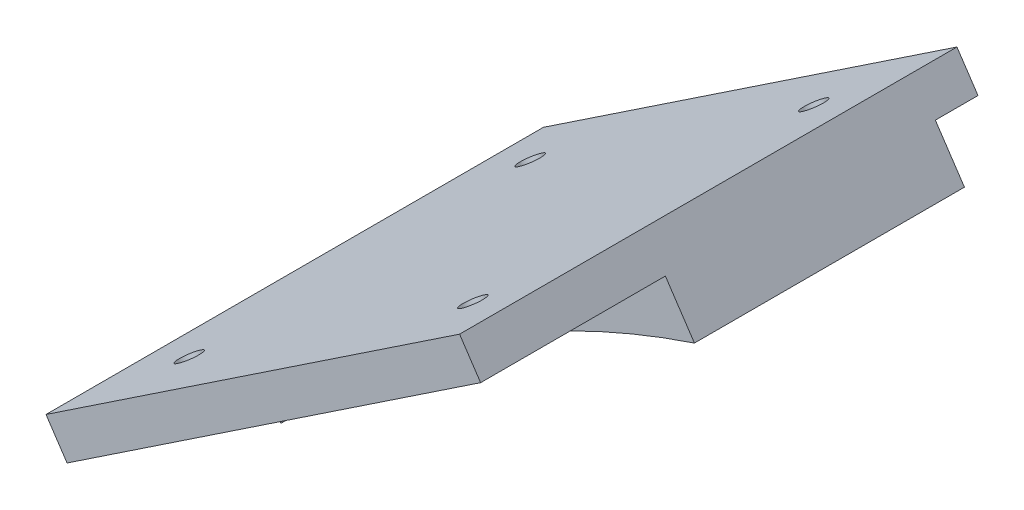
ISO-10303-21;
HEADER;
FILE_DESCRIPTION(('STEP AP214'),'2;1');
FILE_NAME('part.step','',(''),(''),'','','');
FILE_SCHEMA(('AUTOMOTIVE_DESIGN { 1 0 10303 214 1 1 1 1 }'));
ENDSEC;
DATA;
#1=APPLICATION_CONTEXT('core data for automotive mechanical design processes');
#2=APPLICATION_PROTOCOL_DEFINITION('international standard','automotive_design',2000,#1);
#3=PRODUCT_CONTEXT('',#1,'mechanical');
#4=PRODUCT('Part','Part','',(#3));
#5=PRODUCT_RELATED_PRODUCT_CATEGORY('part','',(#4));
#6=PRODUCT_DEFINITION_FORMATION('','',#4);
#7=PRODUCT_DEFINITION_CONTEXT('part definition',#1,'design');
#8=PRODUCT_DEFINITION('design','',#6,#7);
#9=PRODUCT_DEFINITION_SHAPE('','',#8);
#10=(LENGTH_UNIT() NAMED_UNIT(*) SI_UNIT(.MILLI.,.METRE.));
#11=(NAMED_UNIT(*) PLANE_ANGLE_UNIT() SI_UNIT($,.RADIAN.));
#12=(NAMED_UNIT(*) SI_UNIT($,.STERADIAN.) SOLID_ANGLE_UNIT());
#13=UNCERTAINTY_MEASURE_WITH_UNIT(LENGTH_MEASURE(1.E-05),#10,'distance_accuracy_value','');
#14=(GEOMETRIC_REPRESENTATION_CONTEXT(3) GLOBAL_UNCERTAINTY_ASSIGNED_CONTEXT((#13)) GLOBAL_UNIT_ASSIGNED_CONTEXT((#10,
#11,#12)) REPRESENTATION_CONTEXT('',''));
#15=CARTESIAN_POINT('',(0.,0.,0.));
#16=DIRECTION('',(0.,0.,1.));
#17=DIRECTION('',(1.,0.,0.));
#18=AXIS2_PLACEMENT_3D('',#15,#16,#17);
#19=CARTESIAN_POINT('',(0.,-3.80918109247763E-06,-218.25));
#20=DIRECTION('',(0.,1.74532925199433E-08,1.));
#21=DIRECTION('',(-0.831469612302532,-0.555570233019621,9.69652979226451E-09));
#22=AXIS2_PLACEMENT_3D('',#19,#20,#21);
#23=PLANE('',#22);
#24=DIRECTION('',(-0.831469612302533,-0.555570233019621,9.69652979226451E-09));
#25=VECTOR('',#24,1.);
#26=CARTESIAN_POINT('',(-73.5731645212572,204.607521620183,-218.250003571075));
#27=LINE('',#26,#25);
#28=CARTESIAN_POINT('',(-73.5731645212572,204.607521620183,-218.250003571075));
#29=VERTEX_POINT('',#28);
#30=CARTESIAN_POINT('',(-160.877473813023,146.272647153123,-218.250002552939));
#31=VERTEX_POINT('',#30);
#32=EDGE_CURVE('E95',#29,#31,#27,.T.);
#33=ORIENTED_EDGE('',*,*,#32,.F.);
#34=DIRECTION('',(-0.555570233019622,0.831469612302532,-1.45118823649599E-08));
#35=VECTOR('',#34,1.);
#36=CARTESIAN_POINT('',(-69.1286026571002,197.955764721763,-218.25000345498));
#37=LINE('',#36,#35);
#38=CARTESIAN_POINT('',(-69.1286026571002,197.955764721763,-218.25000345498));
#39=VERTEX_POINT('',#38);
#40=EDGE_CURVE('E67',#39,#29,#37,.T.);
#41=ORIENTED_EDGE('',*,*,#40,.F.);
#42=DIRECTION('',(0.831469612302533,0.555570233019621,-9.69652979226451E-09));
#43=VECTOR('',#42,1.);
#44=CARTESIAN_POINT('',(-156.432911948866,139.620890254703,-218.250002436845));
#45=LINE('',#44,#43);
#46=CARTESIAN_POINT('',(-156.432911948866,139.620890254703,-218.250002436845));
#47=VERTEX_POINT('',#46);
#48=EDGE_CURVE('E90',#47,#39,#45,.T.);
#49=ORIENTED_EDGE('',*,*,#48,.F.);
#50=DIRECTION('',(0.555570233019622,-0.831469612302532,1.45118823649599E-08));
#51=VECTOR('',#50,1.);
#52=CARTESIAN_POINT('',(-160.877473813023,146.272647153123,-218.250002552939));
#53=LINE('',#52,#51);
#54=EDGE_CURVE('E11',#31,#47,#53,.T.);
#55=ORIENTED_EDGE('',*,*,#54,.F.);
#56=EDGE_LOOP('',(#33,#41,#49,#55));
#57=FACE_BOUND('',#56,.T.);
#58=ADVANCED_FACE('F40',(#57),#23,.F.);
#59=CARTESIAN_POINT('',(-160.877473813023,146.272647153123,-218.250002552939));
#60=DIRECTION('',(-0.831469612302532,-0.555570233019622,9.69652979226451E-09));
#61=DIRECTION('',(0.555570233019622,-0.831469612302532,1.45118823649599E-08));
#62=AXIS2_PLACEMENT_3D('',#59,#60,#61);
#63=PLANE('',#62);
#64=DIRECTION('',(0.,-1.74532925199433E-08,-1.));
#65=VECTOR('',#64,1.);
#66=CARTESIAN_POINT('',(-156.432911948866,139.620892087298,-113.250002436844));
#67=LINE('',#66,#65);
#68=CARTESIAN_POINT('',(-156.432911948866,139.620892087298,-113.250002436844));
#69=VERTEX_POINT('',#68);
#70=CARTESIAN_POINT('',(-156.432911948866,139.62089140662,-152.250002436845));
#71=VERTEX_POINT('',#70);
#72=EDGE_CURVE('E169',#69,#71,#67,.T.);
#73=ORIENTED_EDGE('',*,*,#72,.F.);
#74=DIRECTION('',(0.555570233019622,-0.831469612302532,1.45118823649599E-08));
#75=VECTOR('',#74,1.);
#76=CARTESIAN_POINT('',(-160.877473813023,146.272648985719,-113.250002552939));
#77=LINE('',#76,#75);
#78=CARTESIAN_POINT('',(-160.877473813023,146.272648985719,-113.250002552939));
#79=VERTEX_POINT('',#78);
#80=EDGE_CURVE('E190',#79,#69,#77,.T.);
#81=ORIENTED_EDGE('',*,*,#80,.F.);
#82=DIRECTION('',(0.,1.74532925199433E-08,1.));
#83=VECTOR('',#82,1.);
#84=CARTESIAN_POINT('',(-160.877473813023,146.272647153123,-218.250002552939));
#85=LINE('',#84,#83);
#86=EDGE_CURVE('E161',#31,#79,#85,.T.);
#87=ORIENTED_EDGE('',*,*,#86,.F.);
#88=ORIENTED_EDGE('',*,*,#54,.T.);
#89=DIRECTION('',(0.,1.74532925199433E-08,1.));
#90=VECTOR('',#89,1.);
#91=CARTESIAN_POINT('',(-156.432911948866,139.620890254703,-218.250002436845));
#92=LINE('',#91,#90);
#93=CARTESIAN_POINT('',(-156.432911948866,139.620890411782,-209.250002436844));
#94=VERTEX_POINT('',#93);
#95=EDGE_CURVE('E56',#47,#94,#92,.T.);
#96=ORIENTED_EDGE('',*,*,#95,.T.);
#97=DIRECTION('',(-0.555570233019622,0.831469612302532,-1.45118823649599E-08));
#98=VECTOR('',#97,1.);
#99=CARTESIAN_POINT('',(-150.293784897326,130.433037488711,-209.250002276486));
#100=LINE('',#99,#98);
#101=CARTESIAN_POINT('',(-150.293784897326,130.433037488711,-209.250002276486));
#102=VERTEX_POINT('',#101);
#103=EDGE_CURVE('E136',#102,#94,#100,.T.);
#104=ORIENTED_EDGE('',*,*,#103,.F.);
#105=DIRECTION('',(0.,1.74532925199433E-08,1.));
#106=VECTOR('',#105,1.);
#107=CARTESIAN_POINT('',(-150.293784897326,130.433037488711,-209.250002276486));
#108=LINE('',#107,#106);
#109=CARTESIAN_POINT('',(-150.293784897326,130.433038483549,-152.250002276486));
#110=VERTEX_POINT('',#109);
#111=EDGE_CURVE('E149',#102,#110,#108,.T.);
#112=ORIENTED_EDGE('',*,*,#111,.T.);
#113=DIRECTION('',(-0.555570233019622,0.831469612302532,-1.45118823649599E-08));
#114=VECTOR('',#113,1.);
#115=CARTESIAN_POINT('',(-150.293784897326,130.433038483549,-152.250002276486));
#116=LINE('',#115,#114);
#117=EDGE_CURVE('E170',#110,#71,#116,.T.);
#118=ORIENTED_EDGE('',*,*,#117,.T.);
#119=EDGE_LOOP('',(#73,#81,#87,#88,#96,#104,#112,#118));
#120=FACE_BOUND('',#119,.T.);
#121=ADVANCED_FACE('F227',(#120),#63,.T.);
#122=CARTESIAN_POINT('',(-46.5089159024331,183.002513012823,-152.250003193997));
#123=DIRECTION('',(0.,-1.74532925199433E-08,-1.));
#124=DIRECTION('',(-0.555570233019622,0.831469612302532,-1.45118823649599E-08));
#125=AXIS2_PLACEMENT_3D('',#122,#123,#124);
#126=PLANE('',#125);
#127=CARTESIAN_POINT('',(0.,-2.65726378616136E-06,-152.25));
#128=DIRECTION('',(0.,1.74532925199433E-08,1.));
#129=DIRECTION('',(-0.316530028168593,0.948582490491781,-1.65558876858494E-08));
#130=AXIS2_PLACEMENT_3D('',#127,#128,#129);
#131=CIRCLE('',#130,199.);
#132=CARTESIAN_POINT('',(-62.9894756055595,188.767912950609,-152.250003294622));
#133=VERTEX_POINT('',#132);
#134=EDGE_CURVE('E137',#133,#110,#131,.T.);
#135=ORIENTED_EDGE('',*,*,#134,.F.);
#136=DIRECTION('',(-0.555570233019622,0.831469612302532,-1.45118823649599E-08));
#137=VECTOR('',#136,1.);
#138=CARTESIAN_POINT('',(-62.9894756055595,188.767912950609,-152.250003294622));
#139=LINE('',#138,#137);
#140=CARTESIAN_POINT('',(-69.1286026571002,197.95576587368,-152.25000345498));
#141=VERTEX_POINT('',#140);
#142=EDGE_CURVE('E131',#133,#141,#139,.T.);
#143=ORIENTED_EDGE('',*,*,#142,.T.);
#144=DIRECTION('',(-0.831469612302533,-0.555570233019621,9.69652979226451E-09));
#145=VECTOR('',#144,1.);
#146=CARTESIAN_POINT('',(-69.1286026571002,197.95576587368,-152.25000345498));
#147=LINE('',#146,#145);
#148=EDGE_CURVE('E165',#141,#71,#147,.T.);
#149=ORIENTED_EDGE('',*,*,#148,.T.);
#150=ORIENTED_EDGE('',*,*,#117,.F.);
#151=EDGE_LOOP('',(#135,#143,#149,#150));
#152=FACE_BOUND('',#151,.T.);
#153=ADVANCED_FACE('F232',(#152),#126,.F.);
#154=CARTESIAN_POINT('',(-60.3981717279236,203.789253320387,-152.250003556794));
#155=DIRECTION('',(-0.555570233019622,0.831469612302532,-1.45118823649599E-08));
#156=DIRECTION('',(0.,-1.74532925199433E-08,-1.));
#157=AXIS2_PLACEMENT_3D('',#154,#155,#156);
#158=PLANE('',#157);
#159=CARTESIAN_POINT('',(-82.8478512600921,188.788857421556,-129.750003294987));
#160=DIRECTION('',(-0.555570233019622,0.831469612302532,-1.45118823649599E-08));
#161=DIRECTION('',(-0.831469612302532,-0.555570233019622,0.));
#162=AXIS2_PLACEMENT_3D('',#159,#160,#161);
#163=CIRCLE('',#162,2.5);
#164=CARTESIAN_POINT('',(-84.9265252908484,187.399931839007,-129.750003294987));
#165=VERTEX_POINT('',#164);
#166=EDGE_CURVE('E414',#165,#165,#163,.T.);
#167=ORIENTED_EDGE('',*,*,#166,.T.);
#168=EDGE_LOOP('',(#167));
#169=FACE_BOUND('',#168,.T.);
#170=CARTESIAN_POINT('',(-142.713663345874,148.787800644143,-129.750002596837));
#171=DIRECTION('',(-0.555570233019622,0.831469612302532,-1.45118823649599E-08));
#172=DIRECTION('',(-0.831469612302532,-0.555570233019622,0.));
#173=AXIS2_PLACEMENT_3D('',#170,#171,#172);
#174=CIRCLE('',#173,2.5);
#175=CARTESIAN_POINT('',(-144.792337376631,147.398875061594,-129.750002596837));
#176=VERTEX_POINT('',#175);
#177=EDGE_CURVE('E164',#176,#176,#174,.T.);
#178=ORIENTED_EDGE('',*,*,#177,.T.);
#179=EDGE_LOOP('',(#178));
#180=FACE_BOUND('',#179,.T.);
#181=ORIENTED_EDGE('',*,*,#72,.T.);
#182=ORIENTED_EDGE('',*,*,#148,.F.);
#183=DIRECTION('',(0.,-1.74532925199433E-08,-1.));
#184=VECTOR('',#183,1.);
#185=CARTESIAN_POINT('',(-69.1286026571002,197.955766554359,-113.25000345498));
#186=LINE('',#185,#184);
#187=CARTESIAN_POINT('',(-69.1286026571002,197.955766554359,-113.25000345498));
#188=VERTEX_POINT('',#187);
#189=EDGE_CURVE('E177',#188,#141,#186,.T.);
#190=ORIENTED_EDGE('',*,*,#189,.F.);
#191=DIRECTION('',(0.831469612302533,0.555570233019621,-9.69652979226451E-09));
#192=VECTOR('',#191,1.);
#193=CARTESIAN_POINT('',(-156.432911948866,139.620892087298,-113.250002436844));
#194=LINE('',#193,#192);
#195=EDGE_CURVE('E186',#69,#188,#194,.T.);
#196=ORIENTED_EDGE('',*,*,#195,.F.);
#197=EDGE_LOOP('',(#181,#182,#190,#196));
#198=FACE_BOUND('',#197,.T.);
#199=ADVANCED_FACE('F228',(#169,#180,#198),#158,.F.);
#200=CARTESIAN_POINT('',(0.,-1.97658537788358E-06,-113.25));
#201=DIRECTION('',(0.,1.74532925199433E-08,1.));
#202=DIRECTION('',(-0.831469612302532,-0.555570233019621,9.69652979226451E-09));
#203=AXIS2_PLACEMENT_3D('',#200,#201,#202);
#204=PLANE('',#203);
#205=DIRECTION('',(-0.555570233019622,0.831469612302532,-1.45118823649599E-08));
#206=VECTOR('',#205,1.);
#207=CARTESIAN_POINT('',(-69.1286026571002,197.955766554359,-113.25000345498));
#208=LINE('',#207,#206);
#209=CARTESIAN_POINT('',(-73.5731645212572,204.607523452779,-113.250003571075));
#210=VERTEX_POINT('',#209);
#211=EDGE_CURVE('E180',#188,#210,#208,.T.);
#212=ORIENTED_EDGE('',*,*,#211,.T.);
#213=DIRECTION('',(-0.831469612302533,-0.555570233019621,9.69652979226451E-09));
#214=VECTOR('',#213,1.);
#215=CARTESIAN_POINT('',(-73.5731645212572,204.607523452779,-113.250003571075));
#216=LINE('',#215,#214);
#217=EDGE_CURVE('E198',#210,#79,#216,.T.);
#218=ORIENTED_EDGE('',*,*,#217,.T.);
#219=ORIENTED_EDGE('',*,*,#80,.T.);
#220=ORIENTED_EDGE('',*,*,#195,.T.);
#221=EDGE_LOOP('',(#212,#218,#219,#220));
#222=FACE_BOUND('',#221,.T.);
#223=ADVANCED_FACE('F231',(#222),#204,.T.);
#224=CARTESIAN_POINT('',(-73.5731645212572,204.607521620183,-218.250003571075));
#225=DIRECTION('',(-0.555570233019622,0.831469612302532,-1.45118823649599E-08));
#226=DIRECTION('',(0.,-1.74532925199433E-08,-1.));
#227=AXIS2_PLACEMENT_3D('',#224,#225,#226);
#228=PLANE('',#227);
#229=CARTESIAN_POINT('',(-147.158225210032,155.439556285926,-201.750002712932));
#230=DIRECTION('',(-0.555570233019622,0.831469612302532,-1.45118823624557E-08));
#231=DIRECTION('',(-0.831469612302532,-0.555570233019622,0.));
#232=AXIS2_PLACEMENT_3D('',#229,#230,#231);
#233=CIRCLE('',#232,2.5);
#234=CARTESIAN_POINT('',(-149.236899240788,154.050630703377,-201.750002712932));
#235=VERTEX_POINT('',#234);
#236=EDGE_CURVE('E392',#235,#235,#233,.T.);
#237=ORIENTED_EDGE('',*,*,#236,.F.);
#238=EDGE_LOOP('',(#237));
#239=FACE_BOUND('',#238,.T.);
#240=CARTESIAN_POINT('',(-87.2924131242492,195.440613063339,-201.750003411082));
#241=DIRECTION('',(-0.555570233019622,0.831469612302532,-1.45118823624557E-08));
#242=DIRECTION('',(-0.831469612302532,-0.555570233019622,0.));
#243=AXIS2_PLACEMENT_3D('',#240,#241,#242);
#244=CIRCLE('',#243,2.5);
#245=CARTESIAN_POINT('',(-89.3710871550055,194.05168748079,-201.750003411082));
#246=VERTEX_POINT('',#245);
#247=EDGE_CURVE('E402',#246,#246,#244,.T.);
#248=ORIENTED_EDGE('',*,*,#247,.F.);
#249=EDGE_LOOP('',(#248));
#250=FACE_BOUND('',#249,.T.);
#251=CARTESIAN_POINT('',(-87.2924131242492,195.440614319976,-129.750003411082));
#252=DIRECTION('',(-0.555570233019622,0.831469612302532,-1.45118823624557E-08));
#253=DIRECTION('',(-0.831469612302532,-0.555570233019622,0.));
#254=AXIS2_PLACEMENT_3D('',#251,#252,#253);
#255=CIRCLE('',#254,2.5);
#256=CARTESIAN_POINT('',(-89.3710871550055,194.051688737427,-129.750003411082));
#257=VERTEX_POINT('',#256);
#258=EDGE_CURVE('E207',#257,#257,#255,.T.);
#259=ORIENTED_EDGE('',*,*,#258,.F.);
#260=EDGE_LOOP('',(#259));
#261=FACE_BOUND('',#260,.T.);
#262=CARTESIAN_POINT('',(-147.158225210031,155.439557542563,-129.750002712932));
#263=DIRECTION('',(-0.555570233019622,0.831469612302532,-1.45118823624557E-08));
#264=DIRECTION('',(-0.831469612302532,-0.555570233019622,0.));
#265=AXIS2_PLACEMENT_3D('',#262,#263,#264);
#266=CIRCLE('',#265,2.5);
#267=CARTESIAN_POINT('',(-149.236899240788,154.050631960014,-129.750002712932));
#268=VERTEX_POINT('',#267);
#269=EDGE_CURVE('E418',#268,#268,#266,.T.);
#270=ORIENTED_EDGE('',*,*,#269,.F.);
#271=EDGE_LOOP('',(#270));
#272=FACE_BOUND('',#271,.T.);
#273=ORIENTED_EDGE('',*,*,#86,.T.);
#274=ORIENTED_EDGE('',*,*,#217,.F.);
#275=DIRECTION('',(0.,1.74532925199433E-08,1.));
#276=VECTOR('',#275,1.);
#277=CARTESIAN_POINT('',(-73.5731645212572,204.607521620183,-218.250003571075));
#278=LINE('',#277,#276);
#279=EDGE_CURVE('E174',#29,#210,#278,.T.);
#280=ORIENTED_EDGE('',*,*,#279,.F.);
#281=ORIENTED_EDGE('',*,*,#32,.T.);
#282=EDGE_LOOP('',(#273,#274,#280,#281));
#283=FACE_BOUND('',#282,.T.);
#284=ADVANCED_FACE('F236',(#239,#250,#261,#272,#283),#228,.T.);
#285=CARTESIAN_POINT('',(-62.9894756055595,188.767911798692,-218.250003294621));
#286=DIRECTION('',(0.831469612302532,0.555570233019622,-9.69652979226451E-09));
#287=DIRECTION('',(0.,1.74532925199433E-08,1.));
#288=AXIS2_PLACEMENT_3D('',#285,#286,#287);
#289=PLANE('',#288);
#290=DIRECTION('',(0.,1.74532925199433E-08,1.));
#291=VECTOR('',#290,1.);
#292=CARTESIAN_POINT('',(-62.9894756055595,188.767911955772,-209.250003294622));
#293=LINE('',#292,#291);
#294=CARTESIAN_POINT('',(-62.9894756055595,188.767911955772,-209.250003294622));
#295=VERTEX_POINT('',#294);
#296=EDGE_CURVE('E124',#295,#133,#293,.T.);
#297=ORIENTED_EDGE('',*,*,#296,.F.);
#298=DIRECTION('',(-0.555570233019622,0.831469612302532,-1.45118823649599E-08));
#299=VECTOR('',#298,1.);
#300=CARTESIAN_POINT('',(-62.9894756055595,188.767911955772,-209.250003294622));
#301=LINE('',#300,#299);
#302=CARTESIAN_POINT('',(-69.1286026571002,197.955764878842,-209.25000345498));
#303=VERTEX_POINT('',#302);
#304=EDGE_CURVE('E127',#295,#303,#301,.T.);
#305=ORIENTED_EDGE('',*,*,#304,.T.);
#306=DIRECTION('',(0.,1.74532925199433E-08,1.));
#307=VECTOR('',#306,1.);
#308=CARTESIAN_POINT('',(-69.1286026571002,197.955764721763,-218.25000345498));
#309=LINE('',#308,#307);
#310=EDGE_CURVE('E428',#39,#303,#309,.T.);
#311=ORIENTED_EDGE('',*,*,#310,.F.);
#312=ORIENTED_EDGE('',*,*,#40,.T.);
#313=ORIENTED_EDGE('',*,*,#279,.T.);
#314=ORIENTED_EDGE('',*,*,#211,.F.);
#315=ORIENTED_EDGE('',*,*,#189,.T.);
#316=ORIENTED_EDGE('',*,*,#142,.F.);
#317=EDGE_LOOP('',(#297,#305,#311,#312,#313,#314,#315,#316));
#318=FACE_BOUND('',#317,.T.);
#319=ADVANCED_FACE('F126',(#318),#289,.T.);
#320=CARTESIAN_POINT('',(-60.3981717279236,203.789251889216,-234.250003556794));
#321=DIRECTION('',(-0.555570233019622,0.831469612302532,-1.45118823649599E-08));
#322=DIRECTION('',(0.,-1.74532925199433E-08,-1.));
#323=AXIS2_PLACEMENT_3D('',#320,#321,#322);
#324=PLANE('',#323);
#325=ORIENTED_EDGE('',*,*,#310,.T.);
#326=DIRECTION('',(-0.831469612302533,-0.555570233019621,9.69652979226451E-09));
#327=VECTOR('',#326,1.);
#328=CARTESIAN_POINT('',(-69.1286026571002,197.955764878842,-209.25000345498));
#329=LINE('',#328,#327);
#330=EDGE_CURVE('E145',#303,#94,#329,.T.);
#331=ORIENTED_EDGE('',*,*,#330,.T.);
#332=ORIENTED_EDGE('',*,*,#95,.F.);
#333=ORIENTED_EDGE('',*,*,#48,.T.);
#334=EDGE_LOOP('',(#325,#331,#332,#333));
#335=FACE_BOUND('',#334,.T.);
#336=ADVANCED_FACE('F247',(#335),#324,.F.);
#337=CARTESIAN_POINT('',(-60.3981717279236,203.789252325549,-209.250003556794));
#338=DIRECTION('',(0.,1.74532925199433E-08,1.));
#339=DIRECTION('',(-0.831469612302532,-0.555570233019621,9.69652979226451E-09));
#340=AXIS2_PLACEMENT_3D('',#337,#338,#339);
#341=PLANE('',#340);
#342=ORIENTED_EDGE('',*,*,#330,.F.);
#343=ORIENTED_EDGE('',*,*,#304,.F.);
#344=CARTESIAN_POINT('',(0.,-3.65210145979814E-06,-209.25));
#345=DIRECTION('',(0.,1.74532925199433E-08,1.));
#346=DIRECTION('',(-0.316530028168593,0.948582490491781,-1.65558876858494E-08));
#347=AXIS2_PLACEMENT_3D('',#344,#345,#346);
#348=CIRCLE('',#347,199.);
#349=EDGE_CURVE('E143',#295,#102,#348,.T.);
#350=ORIENTED_EDGE('',*,*,#349,.T.);
#351=ORIENTED_EDGE('',*,*,#103,.T.);
#352=EDGE_LOOP('',(#342,#343,#350,#351));
#353=FACE_BOUND('',#352,.T.);
#354=ADVANCED_FACE('F141',(#353),#341,.F.);
#355=CARTESIAN_POINT('',(0.,-3.80918109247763E-06,-218.25));
#356=DIRECTION('',(0.,1.74532925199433E-08,1.));
#357=DIRECTION('',(0.831469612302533,0.555570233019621,-9.69652979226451E-09));
#358=AXIS2_PLACEMENT_3D('',#355,#356,#357);
#359=CYLINDRICAL_SURFACE('',#358,199.);
#360=CARTESIAN_POINT('',(-140.192241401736,141.234324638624,-201.750002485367));
#361=CARTESIAN_POINT('',(-140.19223752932,141.234328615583,-201.633637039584));
#362=CARTESIAN_POINT('',(-140.185222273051,141.241293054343,-201.517186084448));
#363=CARTESIAN_POINT('',(-140.1573531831,141.268948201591,-201.287521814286));
#364=CARTESIAN_POINT('',(-140.136482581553,141.289655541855,-201.174312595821));
#365=CARTESIAN_POINT('',(-140.081557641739,141.344110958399,-200.954524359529));
#366=CARTESIAN_POINT('',(-140.047514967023,141.377847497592,-200.847939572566));
#367=CARTESIAN_POINT('',(-139.967275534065,141.457286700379,-200.644268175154));
#368=CARTESIAN_POINT('',(-139.921081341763,141.502986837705,-200.547179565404));
#369=CARTESIAN_POINT('',(-139.817440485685,141.605394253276,-200.364287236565));
#370=CARTESIAN_POINT('',(-139.759901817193,141.662191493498,-200.27858607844));
#371=CARTESIAN_POINT('',(-139.635467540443,141.784846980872,-200.121686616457));
#372=CARTESIAN_POINT('',(-139.568570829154,141.850706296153,-200.050490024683));
#373=CARTESIAN_POINT('',(-139.426046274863,141.990798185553,-199.923317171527));
#374=CARTESIAN_POINT('',(-139.350287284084,142.065156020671,-199.867625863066));
#375=CARTESIAN_POINT('',(-139.193110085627,142.219159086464,-199.774548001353));
#376=CARTESIAN_POINT('',(-139.111691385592,142.298804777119,-199.737163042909));
#377=CARTESIAN_POINT('',(-138.944160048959,142.462392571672,-199.68122200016));
#378=CARTESIAN_POINT('',(-138.857995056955,142.546381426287,-199.66295912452));
#379=CARTESIAN_POINT('',(-138.684532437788,142.715150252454,-199.646751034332));
#380=CARTESIAN_POINT('',(-138.597234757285,142.799930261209,-199.648806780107));
#381=CARTESIAN_POINT('',(-138.423408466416,142.968436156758,-199.673283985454));
#382=CARTESIAN_POINT('',(-138.336888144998,143.052152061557,-199.695833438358));
#383=CARTESIAN_POINT('',(-138.1676742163,143.215594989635,-199.760916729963));
#384=CARTESIAN_POINT('',(-138.084980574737,143.295322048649,-199.803450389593));
#385=CARTESIAN_POINT('',(-137.926234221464,143.448126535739,-199.907149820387));
#386=CARTESIAN_POINT('',(-137.850152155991,143.521233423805,-199.968227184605));
#387=CARTESIAN_POINT('',(-137.706490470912,143.659080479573,-200.107446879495));
#388=CARTESIAN_POINT('',(-137.638910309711,143.723821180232,-200.185588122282));
#389=CARTESIAN_POINT('',(-137.515153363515,143.842235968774,-200.355663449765));
#390=CARTESIAN_POINT('',(-137.458841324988,143.896041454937,-200.447407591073));
#391=CARTESIAN_POINT('',(-137.358312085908,143.99200650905,-200.642838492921));
#392=CARTESIAN_POINT('',(-137.314093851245,144.034167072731,-200.746524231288));
#393=CARTESIAN_POINT('',(-137.239735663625,144.10501918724,-200.961214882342));
#394=CARTESIAN_POINT('',(-137.209393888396,144.133903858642,-201.072086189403));
#395=CARTESIAN_POINT('',(-137.162786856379,144.178257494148,-201.29933358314));
#396=CARTESIAN_POINT('',(-137.146520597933,144.193727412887,-201.415709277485));
#397=CARTESIAN_POINT('',(-137.128687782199,144.21068657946,-201.649272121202));
#398=CARTESIAN_POINT('',(-137.12695963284,144.212329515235,-201.766435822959));
#399=CARTESIAN_POINT('',(-137.137833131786,144.201989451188,-201.99948728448));
#400=CARTESIAN_POINT('',(-137.150434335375,144.190006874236,-202.115375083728));
#401=CARTESIAN_POINT('',(-137.189504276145,144.152834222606,-202.342212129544));
#402=CARTESIAN_POINT('',(-137.215928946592,144.12768611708,-202.453175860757));
#403=CARTESIAN_POINT('',(-137.28179681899,144.064948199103,-202.6674544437));
#404=CARTESIAN_POINT('',(-137.321240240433,144.027358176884,-202.770769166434));
#405=CARTESIAN_POINT('',(-137.412204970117,143.940574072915,-202.967486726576));
#406=CARTESIAN_POINT('',(-137.463794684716,143.891314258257,-203.060828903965));
#407=CARTESIAN_POINT('',(-137.577374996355,143.782721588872,-203.23440018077));
#408=CARTESIAN_POINT('',(-137.63936619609,143.723388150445,-203.314628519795));
#409=CARTESIAN_POINT('',(-137.772779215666,143.595504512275,-203.460795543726));
#410=CARTESIAN_POINT('',(-137.844310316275,143.526847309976,-203.526540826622));
#411=CARTESIAN_POINT('',(-137.994108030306,143.38282991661,-203.640738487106));
#412=CARTESIAN_POINT('',(-138.072375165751,143.307469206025,-203.689189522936));
#413=CARTESIAN_POINT('',(-138.234647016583,143.150949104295,-203.768174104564));
#414=CARTESIAN_POINT('',(-138.318719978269,143.069719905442,-203.79842916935));
#415=CARTESIAN_POINT('',(-138.489160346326,142.904742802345,-203.839129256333));
#416=CARTESIAN_POINT('',(-138.575527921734,142.820994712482,-203.849572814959));
#417=CARTESIAN_POINT('',(-138.749139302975,142.652340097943,-203.850410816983));
#418=CARTESIAN_POINT('',(-138.836381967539,142.56743118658,-203.840577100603));
#419=CARTESIAN_POINT('',(-139.008308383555,142.399801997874,-203.800666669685));
#420=CARTESIAN_POINT('',(-139.092992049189,142.317081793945,-203.770589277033));
#421=CARTESIAN_POINT('',(-139.257604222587,142.156012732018,-203.690881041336));
#422=CARTESIAN_POINT('',(-139.337521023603,142.077674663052,-203.641204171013));
#423=CARTESIAN_POINT('',(-139.49007494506,141.927902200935,-203.523611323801));
#424=CARTESIAN_POINT('',(-139.562712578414,141.856467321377,-203.455696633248));
#425=CARTESIAN_POINT('',(-139.697965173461,141.723274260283,-203.30414053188));
#426=CARTESIAN_POINT('',(-139.760663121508,141.661436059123,-203.220643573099));
#427=CARTESIAN_POINT('',(-139.874936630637,141.548604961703,-203.039804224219));
#428=CARTESIAN_POINT('',(-139.926510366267,141.497613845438,-202.942459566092));
#429=CARTESIAN_POINT('',(-140.016184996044,141.408878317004,-202.738395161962));
#430=CARTESIAN_POINT('',(-140.054489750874,141.370933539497,-202.631851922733));
#431=CARTESIAN_POINT('',(-140.117538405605,141.30844427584,-202.411204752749));
#432=CARTESIAN_POINT('',(-140.142300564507,141.283881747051,-202.297111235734));
#433=CARTESIAN_POINT('',(-140.170655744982,141.255748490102,-202.110178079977));
#434=CARTESIAN_POINT('',(-140.178739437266,141.247725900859,-202.038629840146));
#435=CARTESIAN_POINT('',(-140.189533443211,141.237012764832,-201.894732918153));
#436=CARTESIAN_POINT('',(-140.19224381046,141.234322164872,-201.822384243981));
#437=CARTESIAN_POINT('',(-140.192241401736,141.234324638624,-201.750002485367));
#438=B_SPLINE_CURVE_WITH_KNOTS('',3,(#360,#361,#362,#363,#364,#365,#366,#367,#368,#369,#370,
#371,#372,#373,#374,#375,#376,#377,#378,#379,#380,#381,#382,#383,#384,#385,#386,#387,#388,#389,
#390,#391,#392,#393,#394,#395,#396,#397,#398,#399,#400,#401,#402,#403,#404,#405,#406,#407,#408,
#409,#410,#411,#412,#413,#414,#415,#416,#417,#418,#419,#420,#421,#422,#423,#424,#425,#426,#427,
#428,#429,#430,#431,#432,#433,#434,#435,#436,#437),.UNSPECIFIED.,.T.,.F.,(4,2,2,2,2,2,2,2,2,2,2,
2,2,2,2,2,2,2,2,2,2,2,2,2,2,2,2,2,2,2,2,2,2,2,2,2,2,2,4),(0.,0.348829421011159,
0.698081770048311,1.04702556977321,1.39589574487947,1.74772119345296,2.09958814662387,
2.45754901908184,2.81554107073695,3.17894541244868,3.54236692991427,3.90807391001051,
4.27377761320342,4.63776449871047,5.00172818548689,5.36101948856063,5.72028005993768,
6.07413489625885,6.4279645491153,6.77785609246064,7.12773677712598,7.47650884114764,
7.82528678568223,8.17607808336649,8.52688971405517,8.88213480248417,9.237407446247,
9.59798748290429,9.95859415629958,10.3232805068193,10.6879790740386,11.0535392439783,
11.4190736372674,11.7813741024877,12.1437339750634,12.5002501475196,12.8562844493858,
13.0732658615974,13.290245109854),.UNSPECIFIED.);
#439=CARTESIAN_POINT('',(-140.192241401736,141.234324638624,-201.750002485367));
#440=VERTEX_POINT('',#439);
#441=EDGE_CURVE('E45',#440,#440,#438,.T.);
#442=ORIENTED_EDGE('',*,*,#441,.T.);
#443=EDGE_LOOP('',(#442));
#444=FACE_BOUND('',#443,.T.);
#445=CARTESIAN_POINT('',(-80.7556581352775,181.877767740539,-201.750003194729));
#446=CARTESIAN_POINT('',(-80.7556532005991,181.877770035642,-201.633346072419));
#447=CARTESIAN_POINT('',(-80.7466100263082,181.881786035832,-201.516603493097));
#448=CARTESIAN_POINT('',(-80.7106795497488,181.897733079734,-201.286355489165));
#449=CARTESIAN_POINT('',(-80.6837706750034,181.909673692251,-201.172854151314));
#450=CARTESIAN_POINT('',(-80.6129371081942,181.941074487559,-200.952481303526));
#451=CARTESIAN_POINT('',(-80.5690255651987,181.96052885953,-200.845604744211));
#452=CARTESIAN_POINT('',(-80.4655072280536,182.006329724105,-200.641395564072));
#453=CARTESIAN_POINT('',(-80.4059039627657,182.032674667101,-200.544060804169));
#454=CARTESIAN_POINT('',(-80.2723186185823,182.091622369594,-200.360965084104));
#455=CARTESIAN_POINT('',(-80.1982486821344,182.124263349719,-200.275280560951));
#456=CARTESIAN_POINT('',(-80.038104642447,182.194698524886,-200.11848594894));
#457=CARTESIAN_POINT('',(-79.9520293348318,182.23249323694,-200.047377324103));
#458=CARTESIAN_POINT('',(-79.7690244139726,182.312675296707,-199.920690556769));
#459=CARTESIAN_POINT('',(-79.6719602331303,182.355119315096,-199.865342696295));
#460=CARTESIAN_POINT('',(-79.4707077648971,182.44291540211,-199.772926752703));
#461=CARTESIAN_POINT('',(-79.3665189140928,182.488267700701,-199.735860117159));
#462=CARTESIAN_POINT('',(-79.1523472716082,182.581265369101,-199.680523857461));
#463=CARTESIAN_POINT('',(-79.0423024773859,182.628934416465,-199.662533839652));
#464=CARTESIAN_POINT('',(-78.8209099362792,182.724594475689,-199.646743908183));
#465=CARTESIAN_POINT('',(-78.7095621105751,182.77258550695,-199.648945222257));
#466=CARTESIAN_POINT('',(-78.4876669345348,182.867984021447,-199.673575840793));
#467=CARTESIAN_POINT('',(-78.3771357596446,182.915382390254,-199.696186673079));
#468=CARTESIAN_POINT('',(-78.161051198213,183.007821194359,-199.761295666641));
#469=CARTESIAN_POINT('',(-78.0554978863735,183.052861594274,-199.803794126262));
#470=CARTESIAN_POINT('',(-77.8525472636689,183.139268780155,-199.907504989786));
#471=CARTESIAN_POINT('',(-77.7551408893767,183.18063965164,-199.968696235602));
#472=CARTESIAN_POINT('',(-77.5712573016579,183.258584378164,-200.108177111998));
#473=CARTESIAN_POINT('',(-77.4847795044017,183.295158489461,-200.186465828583));
#474=CARTESIAN_POINT('',(-77.3263651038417,183.362044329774,-200.356971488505));
#475=CARTESIAN_POINT('',(-77.2542686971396,183.392424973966,-200.449012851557));
#476=CARTESIAN_POINT('',(-77.1256187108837,183.446565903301,-200.64512296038));
#477=CARTESIAN_POINT('',(-77.0690635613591,183.470326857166,-200.749190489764));
#478=CARTESIAN_POINT('',(-76.9741761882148,183.510156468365,-200.964434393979));
#479=CARTESIAN_POINT('',(-76.9355408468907,183.526353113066,-201.075453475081));
#480=CARTESIAN_POINT('',(-76.8762953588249,183.551178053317,-201.30300924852));
#481=CARTESIAN_POINT('',(-76.8556834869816,183.559807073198,-201.419545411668));
#482=CARTESIAN_POINT('',(-76.833328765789,183.569165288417,-201.652982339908));
#483=CARTESIAN_POINT('',(-76.8313120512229,183.570009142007,-201.769852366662));
#484=CARTESIAN_POINT('',(-76.8454960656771,183.56407191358,-202.002282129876));
#485=CARTESIAN_POINT('',(-76.8616960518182,183.557291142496,-202.117841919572));
#486=CARTESIAN_POINT('',(-76.9116797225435,183.536353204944,-202.343856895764));
#487=CARTESIAN_POINT('',(-76.9453860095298,183.522228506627,-202.454332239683));
#488=CARTESIAN_POINT('',(-77.0292784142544,183.487032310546,-202.667650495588));
#489=CARTESIAN_POINT('',(-77.0794649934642,183.465960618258,-202.77049319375));
#490=CARTESIAN_POINT('',(-77.1952531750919,183.417271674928,-202.966552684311));
#491=CARTESIAN_POINT('',(-77.2609757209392,183.389603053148,-203.059685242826));
#492=CARTESIAN_POINT('',(-77.4056462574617,183.328586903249,-203.232898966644));
#493=CARTESIAN_POINT('',(-77.4845952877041,183.295238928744,-203.312979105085));
#494=CARTESIAN_POINT('',(-77.6548230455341,183.223185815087,-203.45921566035));
#495=CARTESIAN_POINT('',(-77.7462817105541,183.184402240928,-203.525123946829));
#496=CARTESIAN_POINT('',(-77.93788782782,183.102963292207,-203.639648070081));
#497=CARTESIAN_POINT('',(-78.0380360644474,183.060307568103,-203.688262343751));
#498=CARTESIAN_POINT('',(-78.2459554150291,182.971533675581,-203.767632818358));
#499=CARTESIAN_POINT('',(-78.3538257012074,182.925369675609,-203.798078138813));
#500=CARTESIAN_POINT('',(-78.5726336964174,182.831491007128,-203.839047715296));
#501=CARTESIAN_POINT('',(-78.6835716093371,182.783776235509,-203.84957064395));
#502=CARTESIAN_POINT('',(-78.9064829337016,182.687658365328,-203.850413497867));
#503=CARTESIAN_POINT('',(-79.0184561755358,182.639253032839,-203.840540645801));
#504=CARTESIAN_POINT('',(-79.2392043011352,182.543588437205,-203.800431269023));
#505=CARTESIAN_POINT('',(-79.3479791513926,182.496329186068,-203.770194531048));
#506=CARTESIAN_POINT('',(-79.5590659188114,182.404405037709,-203.690178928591));
#507=CARTESIAN_POINT('',(-79.6613864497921,182.359736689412,-203.640426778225));
#508=CARTESIAN_POINT('',(-79.8567336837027,182.274277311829,-203.522688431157));
#509=CARTESIAN_POINT('',(-79.9497612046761,182.233485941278,-203.454703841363));
#510=CARTESIAN_POINT('',(-80.1227905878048,182.157475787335,-203.303194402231));
#511=CARTESIAN_POINT('',(-80.202924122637,182.122200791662,-203.219848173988));
#512=CARTESIAN_POINT('',(-80.3489920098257,182.057805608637,-203.039415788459));
#513=CARTESIAN_POINT('',(-80.4149239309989,182.028686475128,-202.94232728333));
#514=CARTESIAN_POINT('',(-80.5296849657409,181.977944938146,-202.738719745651));
#515=CARTESIAN_POINT('',(-80.5787494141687,181.956219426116,-202.632358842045));
#516=CARTESIAN_POINT('',(-80.6595413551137,181.920419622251,-202.412141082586));
#517=CARTESIAN_POINT('',(-80.6912915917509,181.906335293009,-202.298294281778));
#518=CARTESIAN_POINT('',(-80.7277835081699,181.890142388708,-202.111386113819));
#519=CARTESIAN_POINT('',(-80.7382226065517,181.885508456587,-202.039597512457));
#520=CARTESIAN_POINT('',(-80.7521614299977,181.879320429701,-201.895218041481));
#521=CARTESIAN_POINT('',(-80.7556612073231,181.877766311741,-201.822627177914));
#522=CARTESIAN_POINT('',(-80.7556581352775,181.877767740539,-201.750003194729));
#523=B_SPLINE_CURVE_WITH_KNOTS('',3,(#445,#446,#447,#448,#449,#450,#451,#452,#453,#454,#455,
#456,#457,#458,#459,#460,#461,#462,#463,#464,#465,#466,#467,#468,#469,#470,#471,#472,#473,#474,
#475,#476,#477,#478,#479,#480,#481,#482,#483,#484,#485,#486,#487,#488,#489,#490,#491,#492,#493,
#494,#495,#496,#497,#498,#499,#500,#501,#502,#503,#504,#505,#506,#507,#508,#509,#510,#511,#512,
#513,#514,#515,#516,#517,#518,#519,#520,#521,#522),.UNSPECIFIED.,.T.,.F.,(4,2,2,2,2,2,2,2,2,2,2,
2,2,2,2,2,2,2,2,2,2,2,2,2,2,2,2,2,2,2,2,2,2,2,2,2,2,2,4),(0.,0.34970429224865,0.699831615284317,
1.04968870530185,1.39946718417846,1.75143994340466,2.10344803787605,2.46036250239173,
2.81730522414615,3.17941025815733,3.54153731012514,3.90691730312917,4.272302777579,
4.63727620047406,5.00223011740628,5.36287003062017,5.72347349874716,6.07773228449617,
6.4319571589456,6.78095660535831,7.12994182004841,7.47739709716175,7.82486210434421,
8.17512669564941,8.52541882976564,8.88141854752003,9.23745043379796,9.59941146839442,
9.96139661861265,10.3268188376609,10.6922448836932,11.0571724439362,11.4220678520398,
11.7829611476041,12.1439161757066,12.4996086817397,12.8548328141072,13.0725401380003,
13.2902458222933),.UNSPECIFIED.);
#524=CARTESIAN_POINT('',(-80.7556581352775,181.877767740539,-201.750003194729));
#525=VERTEX_POINT('',#524);
#526=EDGE_CURVE('E201',#525,#525,#523,.T.);
#527=ORIENTED_EDGE('',*,*,#526,.T.);
#528=EDGE_LOOP('',(#527));
#529=FACE_BOUND('',#528,.T.);
#530=ORIENTED_EDGE('',*,*,#111,.F.);
#531=ORIENTED_EDGE('',*,*,#349,.F.);
#532=ORIENTED_EDGE('',*,*,#296,.T.);
#533=ORIENTED_EDGE('',*,*,#134,.T.);
#534=EDGE_LOOP('',(#530,#531,#532,#533));
#535=FACE_BOUND('',#534,.T.);
#536=ADVANCED_FACE('F42',(#444,#529,#535),#359,.F.);
#537=CARTESIAN_POINT('',(-147.158225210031,155.439557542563,-129.750002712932));
#538=DIRECTION('',(-0.555570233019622,0.831469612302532,-1.45118823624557E-08));
#539=DIRECTION('',(-0.831469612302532,-0.555570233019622,0.));
#540=AXIS2_PLACEMENT_3D('',#537,#538,#539);
#541=CYLINDRICAL_SURFACE('',#540,2.5);
#542=ORIENTED_EDGE('',*,*,#269,.T.);
#543=EDGE_LOOP('',(#542));
#544=FACE_BOUND('',#543,.T.);
#545=ORIENTED_EDGE('',*,*,#177,.F.);
#546=EDGE_LOOP('',(#545));
#547=FACE_BOUND('',#546,.T.);
#548=ADVANCED_FACE('F220',(#544,#547),#541,.F.);
#549=CARTESIAN_POINT('',(-87.2924131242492,195.440614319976,-129.750003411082));
#550=DIRECTION('',(-0.555570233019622,0.831469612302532,-1.45118823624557E-08));
#551=DIRECTION('',(-0.831469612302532,-0.555570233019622,0.));
#552=AXIS2_PLACEMENT_3D('',#549,#550,#551);
#553=CYLINDRICAL_SURFACE('',#552,2.5);
#554=ORIENTED_EDGE('',*,*,#258,.T.);
#555=EDGE_LOOP('',(#554));
#556=FACE_BOUND('',#555,.T.);
#557=ORIENTED_EDGE('',*,*,#166,.F.);
#558=EDGE_LOOP('',(#557));
#559=FACE_BOUND('',#558,.T.);
#560=ADVANCED_FACE('F215',(#556,#559),#553,.F.);
#561=CARTESIAN_POINT('',(-87.2924131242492,195.440613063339,-201.750003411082));
#562=DIRECTION('',(-0.555570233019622,0.831469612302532,-1.45118823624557E-08));
#563=DIRECTION('',(-0.831469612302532,-0.555570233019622,0.));
#564=AXIS2_PLACEMENT_3D('',#561,#562,#563);
#565=CYLINDRICAL_SURFACE('',#564,2.09999999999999);
#566=CARTESIAN_POINT('',(-80.6255695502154,185.462976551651,-201.75000323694));
#567=DIRECTION('',(-0.555570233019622,0.831469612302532,-1.45118823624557E-08));
#568=DIRECTION('',(-0.831469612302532,-0.555570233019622,0.));
#569=AXIS2_PLACEMENT_3D('',#566,#567,#568);
#570=CIRCLE('',#569,2.1);
#571=CARTESIAN_POINT('',(-82.3716557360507,184.29627906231,-201.75000323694));
#572=VERTEX_POINT('',#571);
#573=EDGE_CURVE('E208',#572,#572,#570,.T.);
#574=ORIENTED_EDGE('',*,*,#573,.T.);
#575=EDGE_LOOP('',(#574));
#576=FACE_BOUND('',#575,.T.);
#577=ORIENTED_EDGE('',*,*,#526,.F.);
#578=EDGE_LOOP('',(#577));
#579=FACE_BOUND('',#578,.T.);
#580=ADVANCED_FACE('F209',(#576,#579),#565,.F.);
#581=CARTESIAN_POINT('',(-79.282959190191,186.360080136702,-200.407392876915));
#582=DIRECTION('',(0.555570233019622,-0.831469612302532,1.45118823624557E-08));
#583=DIRECTION('',(0.831469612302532,0.555570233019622,0.));
#584=AXIS2_PLACEMENT_3D('',#581,#582,#583);
#585=PLANE('',#584);
#586=ORIENTED_EDGE('',*,*,#573,.F.);
#587=EDGE_LOOP('',(#586));
#588=FACE_BOUND('',#587,.T.);
#589=CARTESIAN_POINT('',(-80.6255695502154,185.462976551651,-201.75000323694));
#590=DIRECTION('',(-0.555570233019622,0.831469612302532,-1.45118823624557E-08));
#591=DIRECTION('',(-0.831469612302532,-0.555570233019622,0.));
#592=AXIS2_PLACEMENT_3D('',#589,#590,#591);
#593=CIRCLE('',#592,2.50000000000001);
#594=CARTESIAN_POINT('',(-82.7042435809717,184.074050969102,-201.75000323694));
#595=VERTEX_POINT('',#594);
#596=EDGE_CURVE('E406',#595,#595,#593,.T.);
#597=ORIENTED_EDGE('',*,*,#596,.T.);
#598=EDGE_LOOP('',(#597));
#599=FACE_BOUND('',#598,.T.);
#600=ADVANCED_FACE('F214',(#588,#599),#585,.F.);
#601=CARTESIAN_POINT('',(-87.2924131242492,195.440613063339,-201.750003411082));
#602=DIRECTION('',(-0.555570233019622,0.831469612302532,-1.45118823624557E-08));
#603=DIRECTION('',(-0.831469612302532,-0.555570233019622,0.));
#604=AXIS2_PLACEMENT_3D('',#601,#602,#603);
#605=CYLINDRICAL_SURFACE('',#604,2.5);
#606=ORIENTED_EDGE('',*,*,#596,.F.);
#607=EDGE_LOOP('',(#606));
#608=FACE_BOUND('',#607,.T.);
#609=ORIENTED_EDGE('',*,*,#247,.T.);
#610=EDGE_LOOP('',(#609));
#611=FACE_BOUND('',#610,.T.);
#612=ADVANCED_FACE('F292',(#608,#611),#605,.F.);
#613=CARTESIAN_POINT('',(-147.158225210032,155.439556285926,-201.750002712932));
#614=DIRECTION('',(-0.555570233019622,0.831469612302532,-1.45118823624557E-08));
#615=DIRECTION('',(-0.831469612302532,-0.555570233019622,0.));
#616=AXIS2_PLACEMENT_3D('',#613,#614,#615);
#617=CYLINDRICAL_SURFACE('',#616,2.09999999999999);
#618=CARTESIAN_POINT('',(-140.491381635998,145.461919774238,-201.75000253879));
#619=DIRECTION('',(-0.555570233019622,0.831469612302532,-1.45118823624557E-08));
#620=DIRECTION('',(-0.831469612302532,-0.555570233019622,0.));
#621=AXIS2_PLACEMENT_3D('',#618,#619,#620);
#622=CIRCLE('',#621,2.09999999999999);
#623=CARTESIAN_POINT('',(-142.237467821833,144.295222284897,-201.75000253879));
#624=VERTEX_POINT('',#623);
#625=EDGE_CURVE('E396',#624,#624,#622,.T.);
#626=ORIENTED_EDGE('',*,*,#625,.T.);
#627=EDGE_LOOP('',(#626));
#628=FACE_BOUND('',#627,.T.);
#629=ORIENTED_EDGE('',*,*,#441,.F.);
#630=EDGE_LOOP('',(#629));
#631=FACE_BOUND('',#630,.T.);
#632=ADVANCED_FACE('F299',(#628,#631),#617,.F.);
#633=CARTESIAN_POINT('',(-139.148771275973,146.359023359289,-200.407392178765));
#634=DIRECTION('',(0.555570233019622,-0.831469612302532,1.45118823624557E-08));
#635=DIRECTION('',(0.831469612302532,0.555570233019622,0.));
#636=AXIS2_PLACEMENT_3D('',#633,#634,#635);
#637=PLANE('',#636);
#638=ORIENTED_EDGE('',*,*,#625,.F.);
#639=EDGE_LOOP('',(#638));
#640=FACE_BOUND('',#639,.T.);
#641=CARTESIAN_POINT('',(-140.491381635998,145.461919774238,-201.75000253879));
#642=DIRECTION('',(-0.555570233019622,0.831469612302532,-1.45118823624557E-08));
#643=DIRECTION('',(-0.831469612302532,-0.555570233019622,0.));
#644=AXIS2_PLACEMENT_3D('',#641,#642,#643);
#645=CIRCLE('',#644,2.50000000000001);
#646=CARTESIAN_POINT('',(-142.570055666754,144.072994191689,-201.75000253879));
#647=VERTEX_POINT('',#646);
#648=EDGE_CURVE('E389',#647,#647,#645,.T.);
#649=ORIENTED_EDGE('',*,*,#648,.T.);
#650=EDGE_LOOP('',(#649));
#651=FACE_BOUND('',#650,.T.);
#652=ADVANCED_FACE('F306',(#640,#651),#637,.F.);
#653=CARTESIAN_POINT('',(-147.158225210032,155.439556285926,-201.750002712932));
#654=DIRECTION('',(-0.555570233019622,0.831469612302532,-1.45118823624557E-08));
#655=DIRECTION('',(-0.831469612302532,-0.555570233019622,0.));
#656=AXIS2_PLACEMENT_3D('',#653,#654,#655);
#657=CYLINDRICAL_SURFACE('',#656,2.5);
#658=ORIENTED_EDGE('',*,*,#648,.F.);
#659=EDGE_LOOP('',(#658));
#660=FACE_BOUND('',#659,.T.);
#661=ORIENTED_EDGE('',*,*,#236,.T.);
#662=EDGE_LOOP('',(#661));
#663=FACE_BOUND('',#662,.T.);
#664=ADVANCED_FACE('F313',(#660,#663),#657,.F.);
#665=CLOSED_SHELL('',(#58,#121,#153,#199,#223,#284,#319,#336,#354,#536,#548,#560,#580,#600,#612,
#632,#652,#664));
#666=MANIFOLD_SOLID_BREP('B2',#665);
#667=ADVANCED_BREP_SHAPE_REPRESENTATION('',(#18,#666),#14);
#668=SHAPE_DEFINITION_REPRESENTATION(#9,#667);
ENDSEC;
END-ISO-10303-21;
